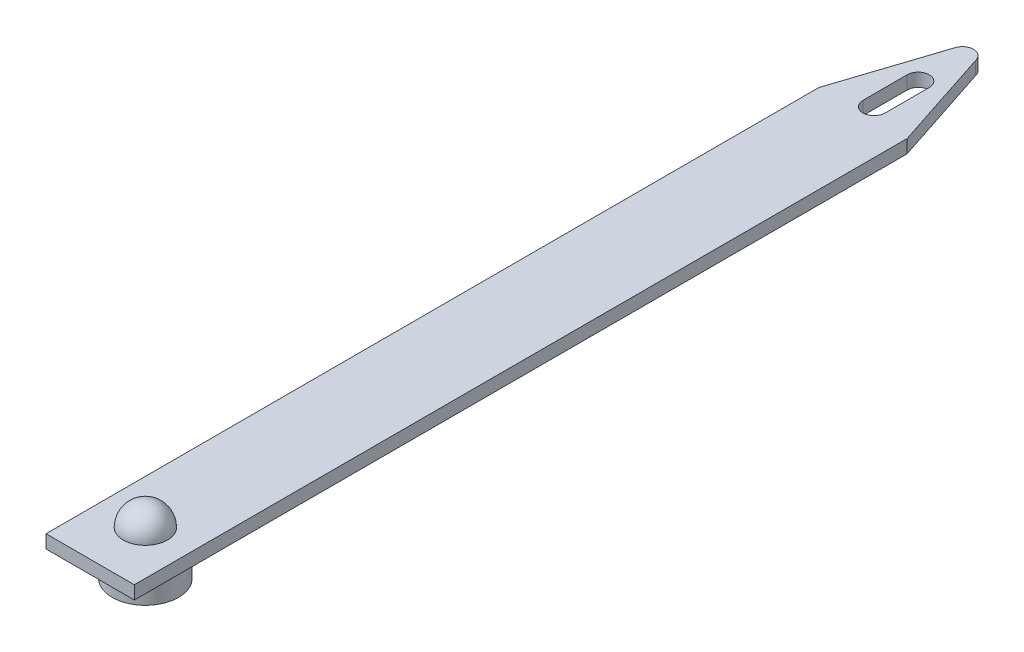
ISO-10303-21;
HEADER;
FILE_DESCRIPTION(('STEP AP214'),'2;1');
FILE_NAME('part.step','',(''),(''),'','','');
FILE_SCHEMA(('AUTOMOTIVE_DESIGN { 1 0 10303 214 1 1 1 1 }'));
ENDSEC;
DATA;
#1=APPLICATION_CONTEXT('core data for automotive mechanical design processes');
#2=APPLICATION_PROTOCOL_DEFINITION('international standard','automotive_design',2000,#1);
#3=PRODUCT_CONTEXT('',#1,'mechanical');
#4=PRODUCT('Part','Part','',(#3));
#5=PRODUCT_RELATED_PRODUCT_CATEGORY('part','',(#4));
#6=PRODUCT_DEFINITION_FORMATION('','',#4);
#7=PRODUCT_DEFINITION_CONTEXT('part definition',#1,'design');
#8=PRODUCT_DEFINITION('design','',#6,#7);
#9=PRODUCT_DEFINITION_SHAPE('','',#8);
#10=(LENGTH_UNIT() NAMED_UNIT(*) SI_UNIT(.MILLI.,.METRE.));
#11=(NAMED_UNIT(*) PLANE_ANGLE_UNIT() SI_UNIT($,.RADIAN.));
#12=(NAMED_UNIT(*) SI_UNIT($,.STERADIAN.) SOLID_ANGLE_UNIT());
#13=UNCERTAINTY_MEASURE_WITH_UNIT(LENGTH_MEASURE(1.E-05),#10,'distance_accuracy_value','');
#14=(GEOMETRIC_REPRESENTATION_CONTEXT(3) GLOBAL_UNCERTAINTY_ASSIGNED_CONTEXT((#13)) GLOBAL_UNIT_ASSIGNED_CONTEXT((#10,
#11,#12)) REPRESENTATION_CONTEXT('',''));
#15=CARTESIAN_POINT('',(0.,0.,0.));
#16=DIRECTION('',(0.,0.,1.));
#17=DIRECTION('',(1.,0.,0.));
#18=AXIS2_PLACEMENT_3D('',#15,#16,#17);
#19=CARTESIAN_POINT('',(0.,0.,-20.));
#20=DIRECTION('',(0.,-1.,0.));
#21=DIRECTION('',(0.,0.,-1.));
#22=AXIS2_PLACEMENT_3D('',#19,#20,#21);
#23=PLANE('',#22);
#24=DIRECTION('',(0.311256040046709,0.,-0.950326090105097));
#25=VECTOR('',#24,1.);
#26=CARTESIAN_POINT('',(-7.28610313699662,0.,7.24591016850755));
#27=LINE('',#26,#25);
#28=CARTESIAN_POINT('',(0.,0.,-15.));
#29=VERTEX_POINT('',#28);
#30=CARTESIAN_POINT('',(1.52483695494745,0.,-19.6556280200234));
#31=VERTEX_POINT('',#30);
#32=EDGE_CURVE('E216',#29,#31,#27,.T.);
#33=ORIENTED_EDGE('',*,*,#32,.T.);
#34=CARTESIAN_POINT('',(2.,0.,-19.5));
#35=DIRECTION('',(0.,1.,0.));
#36=DIRECTION('',(0.,0.,1.));
#37=AXIS2_PLACEMENT_3D('',#34,#35,#36);
#38=CIRCLE('',#37,0.5);
#39=CARTESIAN_POINT('',(2.4903123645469,0.,-19.5979478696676));
#40=VERTEX_POINT('',#39);
#41=EDGE_CURVE('E231',#40,#31,#38,.T.);
#42=ORIENTED_EDGE('',*,*,#41,.F.);
#43=DIRECTION('',(-0.311954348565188,0.,-0.95009709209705));
#44=VECTOR('',#43,1.);
#45=CARTESIAN_POINT('',(5.1945609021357,0.,-11.3618111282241));
#46=LINE('',#45,#44);
#47=CARTESIAN_POINT('',(4.,0.,-15.));
#48=VERTEX_POINT('',#47);
#49=EDGE_CURVE('E233',#48,#40,#46,.T.);
#50=ORIENTED_EDGE('',*,*,#49,.F.);
#51=DIRECTION('',(0.,0.,1.));
#52=VECTOR('',#51,1.);
#53=CARTESIAN_POINT('',(4.,0.,-20.));
#54=LINE('',#53,#52);
#55=CARTESIAN_POINT('',(4.,0.,20.));
#56=VERTEX_POINT('',#55);
#57=EDGE_CURVE('E256',#48,#56,#54,.T.);
#58=ORIENTED_EDGE('',*,*,#57,.T.);
#59=DIRECTION('',(1.,0.,0.));
#60=VECTOR('',#59,1.);
#61=CARTESIAN_POINT('',(0.,0.,20.));
#62=LINE('',#61,#60);
#63=CARTESIAN_POINT('',(0.,0.,20.));
#64=VERTEX_POINT('',#63);
#65=EDGE_CURVE('E247',#64,#56,#62,.T.);
#66=ORIENTED_EDGE('',*,*,#65,.F.);
#67=DIRECTION('',(0.,0.,1.));
#68=VECTOR('',#67,1.);
#69=CARTESIAN_POINT('',(0.,0.,-20.));
#70=LINE('',#69,#68);
#71=EDGE_CURVE('E107',#29,#64,#70,.T.);
#72=ORIENTED_EDGE('',*,*,#71,.F.);
#73=EDGE_LOOP('',(#33,#42,#50,#58,#66,#72));
#74=FACE_BOUND('',#73,.T.);
#75=CARTESIAN_POINT('',(2.,0.,-17.5));
#76=DIRECTION('',(0.,1.,0.));
#77=DIRECTION('',(0.,0.,1.));
#78=AXIS2_PLACEMENT_3D('',#75,#76,#77);
#79=CIRCLE('',#78,0.5);
#80=CARTESIAN_POINT('',(2.5,0.,-17.5));
#81=VERTEX_POINT('',#80);
#82=CARTESIAN_POINT('',(1.5,0.,-17.5));
#83=VERTEX_POINT('',#82);
#84=EDGE_CURVE('E189',#81,#83,#79,.T.);
#85=ORIENTED_EDGE('',*,*,#84,.T.);
#86=DIRECTION('',(0.,0.,-1.));
#87=VECTOR('',#86,1.);
#88=CARTESIAN_POINT('',(1.5,0.,0.));
#89=LINE('',#88,#87);
#90=CARTESIAN_POINT('',(1.5,0.,-15.5));
#91=VERTEX_POINT('',#90);
#92=EDGE_CURVE('E181',#91,#83,#89,.T.);
#93=ORIENTED_EDGE('',*,*,#92,.F.);
#94=CARTESIAN_POINT('',(2.,0.,-15.5));
#95=DIRECTION('',(0.,1.,0.));
#96=DIRECTION('',(0.,0.,1.));
#97=AXIS2_PLACEMENT_3D('',#94,#95,#96);
#98=CIRCLE('',#97,0.5);
#99=CARTESIAN_POINT('',(2.5,0.,-15.5));
#100=VERTEX_POINT('',#99);
#101=EDGE_CURVE('E128',#91,#100,#98,.T.);
#102=ORIENTED_EDGE('',*,*,#101,.T.);
#103=DIRECTION('',(0.,0.,-1.));
#104=VECTOR('',#103,1.);
#105=CARTESIAN_POINT('',(2.5,0.,0.));
#106=LINE('',#105,#104);
#107=EDGE_CURVE('E194',#100,#81,#106,.T.);
#108=ORIENTED_EDGE('',*,*,#107,.T.);
#109=EDGE_LOOP('',(#85,#93,#102,#108));
#110=FACE_BOUND('',#109,.T.);
#111=CARTESIAN_POINT('',(2.,0.,17.5));
#112=DIRECTION('',(0.,-1.,0.));
#113=DIRECTION('',(0.,0.,-1.));
#114=AXIS2_PLACEMENT_3D('',#111,#112,#113);
#115=CIRCLE('',#114,1.5);
#116=CARTESIAN_POINT('',(2.,0.,16.));
#117=VERTEX_POINT('',#116);
#118=EDGE_CURVE('E424',#117,#117,#115,.T.);
#119=ORIENTED_EDGE('',*,*,#118,.F.);
#120=EDGE_LOOP('',(#119));
#121=FACE_BOUND('',#120,.T.);
#122=ADVANCED_FACE('F103',(#74,#110,#121),#23,.T.);
#123=CARTESIAN_POINT('',(0.,0.6,-20.));
#124=DIRECTION('',(0.,1.,0.));
#125=DIRECTION('',(0.,0.,1.));
#126=AXIS2_PLACEMENT_3D('',#123,#124,#125);
#127=PLANE('',#126);
#128=CARTESIAN_POINT('',(2.,0.6,-19.5));
#129=DIRECTION('',(0.,1.,0.));
#130=DIRECTION('',(0.,0.,1.));
#131=AXIS2_PLACEMENT_3D('',#128,#129,#130);
#132=CIRCLE('',#131,0.5);
#133=CARTESIAN_POINT('',(2.4903123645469,0.6,-19.5979478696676));
#134=VERTEX_POINT('',#133);
#135=CARTESIAN_POINT('',(1.52483695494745,0.6,-19.6556280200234));
#136=VERTEX_POINT('',#135);
#137=EDGE_CURVE('E228',#134,#136,#132,.T.);
#138=ORIENTED_EDGE('',*,*,#137,.T.);
#139=DIRECTION('',(0.311256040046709,0.,-0.950326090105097));
#140=VECTOR('',#139,1.);
#141=CARTESIAN_POINT('',(-7.28610313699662,0.6,7.24591016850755));
#142=LINE('',#141,#140);
#143=CARTESIAN_POINT('',(0.,0.6,-15.));
#144=VERTEX_POINT('',#143);
#145=EDGE_CURVE('E222',#144,#136,#142,.T.);
#146=ORIENTED_EDGE('',*,*,#145,.F.);
#147=DIRECTION('',(0.,0.,1.));
#148=VECTOR('',#147,1.);
#149=CARTESIAN_POINT('',(0.,0.6,-20.));
#150=LINE('',#149,#148);
#151=CARTESIAN_POINT('',(0.,0.6,20.));
#152=VERTEX_POINT('',#151);
#153=EDGE_CURVE('E12',#144,#152,#150,.T.);
#154=ORIENTED_EDGE('',*,*,#153,.T.);
#155=DIRECTION('',(-1.,0.,0.));
#156=VECTOR('',#155,1.);
#157=CARTESIAN_POINT('',(0.,0.6,20.));
#158=LINE('',#157,#156);
#159=CARTESIAN_POINT('',(4.,0.6,20.));
#160=VERTEX_POINT('',#159);
#161=EDGE_CURVE('E253',#160,#152,#158,.T.);
#162=ORIENTED_EDGE('',*,*,#161,.F.);
#163=DIRECTION('',(0.,0.,1.));
#164=VECTOR('',#163,1.);
#165=CARTESIAN_POINT('',(4.,0.6,-20.));
#166=LINE('',#165,#164);
#167=CARTESIAN_POINT('',(4.,0.6,-15.));
#168=VERTEX_POINT('',#167);
#169=EDGE_CURVE('E112',#168,#160,#166,.T.);
#170=ORIENTED_EDGE('',*,*,#169,.F.);
#171=DIRECTION('',(-0.311954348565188,0.,-0.95009709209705));
#172=VECTOR('',#171,1.);
#173=CARTESIAN_POINT('',(5.1945609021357,0.6,-11.3618111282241));
#174=LINE('',#173,#172);
#175=EDGE_CURVE('E234',#168,#134,#174,.T.);
#176=ORIENTED_EDGE('',*,*,#175,.T.);
#177=EDGE_LOOP('',(#138,#146,#154,#162,#170,#176));
#178=FACE_BOUND('',#177,.T.);
#179=CARTESIAN_POINT('',(2.,0.6,-17.5));
#180=DIRECTION('',(0.,1.,0.));
#181=DIRECTION('',(0.,0.,1.));
#182=AXIS2_PLACEMENT_3D('',#179,#180,#181);
#183=CIRCLE('',#182,0.5);
#184=CARTESIAN_POINT('',(2.5,0.6,-17.5));
#185=VERTEX_POINT('',#184);
#186=CARTESIAN_POINT('',(1.5,0.6,-17.5));
#187=VERTEX_POINT('',#186);
#188=EDGE_CURVE('E120',#185,#187,#183,.T.);
#189=ORIENTED_EDGE('',*,*,#188,.F.);
#190=DIRECTION('',(0.,0.,-1.));
#191=VECTOR('',#190,1.);
#192=CARTESIAN_POINT('',(2.5,0.6,0.));
#193=LINE('',#192,#191);
#194=CARTESIAN_POINT('',(2.5,0.6,-15.5));
#195=VERTEX_POINT('',#194);
#196=EDGE_CURVE('E198',#195,#185,#193,.T.);
#197=ORIENTED_EDGE('',*,*,#196,.F.);
#198=CARTESIAN_POINT('',(2.,0.6,-15.5));
#199=DIRECTION('',(0.,1.,0.));
#200=DIRECTION('',(0.,0.,1.));
#201=AXIS2_PLACEMENT_3D('',#198,#199,#200);
#202=CIRCLE('',#201,0.5);
#203=CARTESIAN_POINT('',(1.5,0.6,-15.5));
#204=VERTEX_POINT('',#203);
#205=EDGE_CURVE('E201',#204,#195,#202,.T.);
#206=ORIENTED_EDGE('',*,*,#205,.F.);
#207=DIRECTION('',(0.,0.,-1.));
#208=VECTOR('',#207,1.);
#209=CARTESIAN_POINT('',(1.5,0.6,0.));
#210=LINE('',#209,#208);
#211=EDGE_CURVE('E210',#204,#187,#210,.T.);
#212=ORIENTED_EDGE('',*,*,#211,.T.);
#213=EDGE_LOOP('',(#189,#197,#206,#212));
#214=FACE_BOUND('',#213,.T.);
#215=CARTESIAN_POINT('',(2.,0.6,17.5));
#216=DIRECTION('',(0.,1.,0.));
#217=DIRECTION('',(0.,0.,1.));
#218=AXIS2_PLACEMENT_3D('',#215,#216,#217);
#219=CIRCLE('',#218,1.);
#220=CARTESIAN_POINT('',(2.,0.6,18.5));
#221=VERTEX_POINT('',#220);
#222=EDGE_CURVE('E204',#221,#221,#219,.T.);
#223=ORIENTED_EDGE('',*,*,#222,.F.);
#224=EDGE_LOOP('',(#223));
#225=FACE_BOUND('',#224,.T.);
#226=ADVANCED_FACE('F273',(#178,#214,#225),#127,.T.);
#227=CARTESIAN_POINT('',(4.,0.,-20.));
#228=DIRECTION('',(1.,0.,0.));
#229=DIRECTION('',(0.,0.,-1.));
#230=AXIS2_PLACEMENT_3D('',#227,#228,#229);
#231=PLANE('',#230);
#232=ORIENTED_EDGE('',*,*,#57,.F.);
#233=DIRECTION('',(0.,1.,0.));
#234=VECTOR('',#233,1.);
#235=CARTESIAN_POINT('',(4.,0.,-15.));
#236=LINE('',#235,#234);
#237=EDGE_CURVE('E240',#48,#168,#236,.T.);
#238=ORIENTED_EDGE('',*,*,#237,.T.);
#239=ORIENTED_EDGE('',*,*,#169,.T.);
#240=DIRECTION('',(0.,1.,0.));
#241=VECTOR('',#240,1.);
#242=CARTESIAN_POINT('',(4.,0.,20.));
#243=LINE('',#242,#241);
#244=EDGE_CURVE('E250',#56,#160,#243,.T.);
#245=ORIENTED_EDGE('',*,*,#244,.F.);
#246=EDGE_LOOP('',(#232,#238,#239,#245));
#247=FACE_BOUND('',#246,.T.);
#248=ADVANCED_FACE('F287',(#247),#231,.T.);
#249=CARTESIAN_POINT('',(0.,0.,-20.));
#250=DIRECTION('',(-1.,0.,0.));
#251=DIRECTION('',(0.,0.,1.));
#252=AXIS2_PLACEMENT_3D('',#249,#250,#251);
#253=PLANE('',#252);
#254=DIRECTION('',(0.,1.,0.));
#255=VECTOR('',#254,1.);
#256=CARTESIAN_POINT('',(0.,0.,-15.));
#257=LINE('',#256,#255);
#258=EDGE_CURVE('E220',#29,#144,#257,.T.);
#259=ORIENTED_EDGE('',*,*,#258,.F.);
#260=ORIENTED_EDGE('',*,*,#71,.T.);
#261=DIRECTION('',(0.,-1.,0.));
#262=VECTOR('',#261,1.);
#263=CARTESIAN_POINT('',(0.,0.,20.));
#264=LINE('',#263,#262);
#265=EDGE_CURVE('E243',#152,#64,#264,.T.);
#266=ORIENTED_EDGE('',*,*,#265,.F.);
#267=ORIENTED_EDGE('',*,*,#153,.F.);
#268=EDGE_LOOP('',(#259,#260,#266,#267));
#269=FACE_BOUND('',#268,.T.);
#270=ADVANCED_FACE('F265',(#269),#253,.T.);
#271=CARTESIAN_POINT('',(0.,0.6,20.));
#272=DIRECTION('',(0.,0.,-1.));
#273=DIRECTION('',(-1.,0.,0.));
#274=AXIS2_PLACEMENT_3D('',#271,#272,#273);
#275=PLANE('',#274);
#276=ORIENTED_EDGE('',*,*,#265,.T.);
#277=ORIENTED_EDGE('',*,*,#65,.T.);
#278=ORIENTED_EDGE('',*,*,#244,.T.);
#279=ORIENTED_EDGE('',*,*,#161,.T.);
#280=EDGE_LOOP('',(#276,#277,#278,#279));
#281=FACE_BOUND('',#280,.T.);
#282=ADVANCED_FACE('F269',(#281),#275,.F.);
#283=CARTESIAN_POINT('',(2.,0.,-19.5));
#284=DIRECTION('',(0.,1.,0.));
#285=DIRECTION('',(0.,0.,1.));
#286=AXIS2_PLACEMENT_3D('',#283,#284,#285);
#287=CYLINDRICAL_SURFACE('',#286,0.5);
#288=ORIENTED_EDGE('',*,*,#137,.F.);
#289=DIRECTION('',(0.,1.,0.));
#290=VECTOR('',#289,1.);
#291=CARTESIAN_POINT('',(2.4903123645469,0.,-19.5979478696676));
#292=LINE('',#291,#290);
#293=EDGE_CURVE('E236',#40,#134,#292,.T.);
#294=ORIENTED_EDGE('',*,*,#293,.F.);
#295=ORIENTED_EDGE('',*,*,#41,.T.);
#296=DIRECTION('',(0.,1.,0.));
#297=VECTOR('',#296,1.);
#298=CARTESIAN_POINT('',(1.52483695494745,0.,-19.6556280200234));
#299=LINE('',#298,#297);
#300=EDGE_CURVE('E223',#31,#136,#299,.T.);
#301=ORIENTED_EDGE('',*,*,#300,.T.);
#302=EDGE_LOOP('',(#288,#294,#295,#301));
#303=FACE_BOUND('',#302,.T.);
#304=ADVANCED_FACE('F283',(#303),#287,.T.);
#305=CARTESIAN_POINT('',(5.1945609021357,0.,-11.3618111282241));
#306=DIRECTION('',(0.95009709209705,0.,-0.311954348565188));
#307=DIRECTION('',(-0.311954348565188,0.,-0.95009709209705));
#308=AXIS2_PLACEMENT_3D('',#305,#306,#307);
#309=PLANE('',#308);
#310=ORIENTED_EDGE('',*,*,#175,.F.);
#311=ORIENTED_EDGE('',*,*,#237,.F.);
#312=ORIENTED_EDGE('',*,*,#49,.T.);
#313=ORIENTED_EDGE('',*,*,#293,.T.);
#314=EDGE_LOOP('',(#310,#311,#312,#313));
#315=FACE_BOUND('',#314,.T.);
#316=ADVANCED_FACE('F285',(#315),#309,.T.);
#317=CARTESIAN_POINT('',(-7.28610313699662,0.,7.24591016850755));
#318=DIRECTION('',(0.950326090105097,0.,0.311256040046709));
#319=DIRECTION('',(0.311256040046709,0.,-0.950326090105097));
#320=AXIS2_PLACEMENT_3D('',#317,#318,#319);
#321=PLANE('',#320);
#322=ORIENTED_EDGE('',*,*,#145,.T.);
#323=ORIENTED_EDGE('',*,*,#300,.F.);
#324=ORIENTED_EDGE('',*,*,#32,.F.);
#325=ORIENTED_EDGE('',*,*,#258,.T.);
#326=EDGE_LOOP('',(#322,#323,#324,#325));
#327=FACE_BOUND('',#326,.T.);
#328=ADVANCED_FACE('F279',(#327),#321,.F.);
#329=CARTESIAN_POINT('',(2.,0.,-17.5));
#330=DIRECTION('',(0.,1.,0.));
#331=DIRECTION('',(0.,0.,1.));
#332=AXIS2_PLACEMENT_3D('',#329,#330,#331);
#333=CYLINDRICAL_SURFACE('',#332,0.5);
#334=ORIENTED_EDGE('',*,*,#188,.T.);
#335=DIRECTION('',(0.,1.,0.));
#336=VECTOR('',#335,1.);
#337=CARTESIAN_POINT('',(1.5,0.,-17.5));
#338=LINE('',#337,#336);
#339=EDGE_CURVE('E184',#83,#187,#338,.T.);
#340=ORIENTED_EDGE('',*,*,#339,.F.);
#341=ORIENTED_EDGE('',*,*,#84,.F.);
#342=DIRECTION('',(0.,1.,0.));
#343=VECTOR('',#342,1.);
#344=CARTESIAN_POINT('',(2.5,0.,-17.5));
#345=LINE('',#344,#343);
#346=EDGE_CURVE('E214',#81,#185,#345,.T.);
#347=ORIENTED_EDGE('',*,*,#346,.T.);
#348=EDGE_LOOP('',(#334,#340,#341,#347));
#349=FACE_BOUND('',#348,.T.);
#350=ADVANCED_FACE('F192',(#349),#333,.F.);
#351=CARTESIAN_POINT('',(2.5,0.,0.));
#352=DIRECTION('',(1.,0.,0.));
#353=DIRECTION('',(0.,0.,-1.));
#354=AXIS2_PLACEMENT_3D('',#351,#352,#353);
#355=PLANE('',#354);
#356=ORIENTED_EDGE('',*,*,#196,.T.);
#357=ORIENTED_EDGE('',*,*,#346,.F.);
#358=ORIENTED_EDGE('',*,*,#107,.F.);
#359=DIRECTION('',(0.,1.,0.));
#360=VECTOR('',#359,1.);
#361=CARTESIAN_POINT('',(2.5,0.,-15.5));
#362=LINE('',#361,#360);
#363=EDGE_CURVE('E217',#100,#195,#362,.T.);
#364=ORIENTED_EDGE('',*,*,#363,.T.);
#365=EDGE_LOOP('',(#356,#357,#358,#364));
#366=FACE_BOUND('',#365,.T.);
#367=ADVANCED_FACE('F346',(#366),#355,.F.);
#368=CARTESIAN_POINT('',(2.,0.,-15.5));
#369=DIRECTION('',(0.,1.,0.));
#370=DIRECTION('',(0.,0.,1.));
#371=AXIS2_PLACEMENT_3D('',#368,#369,#370);
#372=CYLINDRICAL_SURFACE('',#371,0.5);
#373=ORIENTED_EDGE('',*,*,#205,.T.);
#374=ORIENTED_EDGE('',*,*,#363,.F.);
#375=ORIENTED_EDGE('',*,*,#101,.F.);
#376=DIRECTION('',(0.,1.,0.));
#377=VECTOR('',#376,1.);
#378=CARTESIAN_POINT('',(1.5,0.,-15.5));
#379=LINE('',#378,#377);
#380=EDGE_CURVE('E186',#91,#204,#379,.T.);
#381=ORIENTED_EDGE('',*,*,#380,.T.);
#382=EDGE_LOOP('',(#373,#374,#375,#381));
#383=FACE_BOUND('',#382,.T.);
#384=ADVANCED_FACE('F349',(#383),#372,.F.);
#385=CARTESIAN_POINT('',(1.5,0.,0.));
#386=DIRECTION('',(1.,0.,0.));
#387=DIRECTION('',(0.,0.,-1.));
#388=AXIS2_PLACEMENT_3D('',#385,#386,#387);
#389=PLANE('',#388);
#390=ORIENTED_EDGE('',*,*,#211,.F.);
#391=ORIENTED_EDGE('',*,*,#380,.F.);
#392=ORIENTED_EDGE('',*,*,#92,.T.);
#393=ORIENTED_EDGE('',*,*,#339,.T.);
#394=EDGE_LOOP('',(#390,#391,#392,#393));
#395=FACE_BOUND('',#394,.T.);
#396=ADVANCED_FACE('F183',(#395),#389,.T.);
#397=CARTESIAN_POINT('',(2.,0.6,17.5));
#398=DIRECTION('',(0.,0.,1.));
#399=DIRECTION('',(1.,0.,0.));
#400=AXIS2_PLACEMENT_3D('',#397,#398,#399);
#401=SPHERICAL_SURFACE('',#400,1.);
#402=CARTESIAN_POINT('',(2.,0.6,17.5));
#403=DIRECTION('',(0.,1.,0.));
#404=DIRECTION('',(0.,0.,1.));
#405=AXIS2_PLACEMENT_3D('',#402,#403,#404);
#406=SPHERICAL_SURFACE('',#405,1.);
#407=ORIENTED_EDGE('',*,*,#222,.T.);
#408=EDGE_LOOP('',(#407));
#409=FACE_BOUND('',#408,.T.);
#410=ADVANCED_FACE('F105',(#409),#406,.T.);
#411=CARTESIAN_POINT('',(2.,-1.4,17.5));
#412=DIRECTION('',(0.,1.,0.));
#413=DIRECTION('',(0.,0.,1.));
#414=AXIS2_PLACEMENT_3D('',#411,#412,#413);
#415=CYLINDRICAL_SURFACE('',#414,1.5);
#416=CARTESIAN_POINT('',(2.,-1.4,17.5));
#417=DIRECTION('',(0.,-1.,0.));
#418=DIRECTION('',(0.,0.,-1.));
#419=AXIS2_PLACEMENT_3D('',#416,#417,#418);
#420=CIRCLE('',#419,1.5);
#421=CARTESIAN_POINT('',(2.,-1.4,16.));
#422=VERTEX_POINT('',#421);
#423=EDGE_CURVE('E423',#422,#422,#420,.T.);
#424=ORIENTED_EDGE('',*,*,#423,.F.);
#425=EDGE_LOOP('',(#424));
#426=FACE_BOUND('',#425,.T.);
#427=ORIENTED_EDGE('',*,*,#118,.T.);
#428=EDGE_LOOP('',(#427));
#429=FACE_BOUND('',#428,.T.);
#430=ADVANCED_FACE('F317',(#426,#429),#415,.T.);
#431=CARTESIAN_POINT('',(2.,-1.4,17.5));
#432=DIRECTION('',(0.,-1.,0.));
#433=DIRECTION('',(0.,0.,-1.));
#434=AXIS2_PLACEMENT_3D('',#431,#432,#433);
#435=PLANE('',#434);
#436=ORIENTED_EDGE('',*,*,#423,.T.);
#437=EDGE_LOOP('',(#436));
#438=FACE_BOUND('',#437,.T.);
#439=ADVANCED_FACE('F327',(#438),#435,.T.);
#440=CLOSED_SHELL('',(#122,#226,#248,#270,#282,#304,#316,#328,#350,#367,#384,#396,#410,#430,#439));
#441=MANIFOLD_SOLID_BREP('B2',#440);
#442=ADVANCED_BREP_SHAPE_REPRESENTATION('',(#18,#441),#14);
#443=SHAPE_DEFINITION_REPRESENTATION(#9,#442);
ENDSEC;
END-ISO-10303-21;
